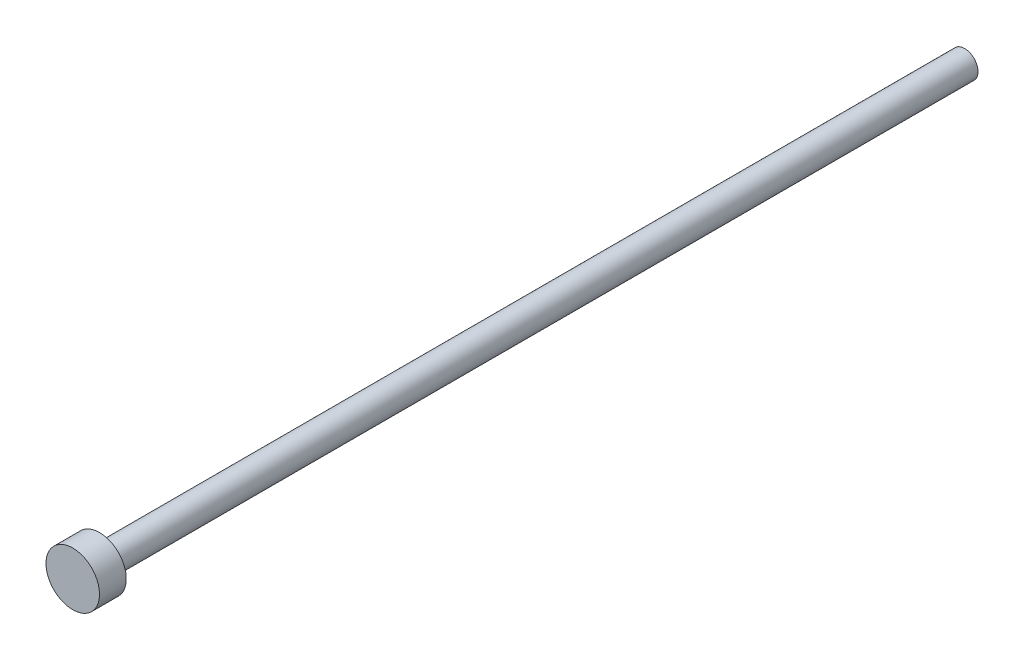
from build123d import *


with BuildPart() as part:
    # Sketch1 → Revolve1 (revolve)
    with BuildSketch(Plane(origin=(0, -18, -1.35), x_dir=(0, 0, -1), z_dir=(1, 0, 0)), mode=Mode.PRIVATE) as revolve1_sk:
        with BuildLine():
            Line((-1.35, 18), (-1.35, 21))
            Line((-1.35, 21), (1.65, 21))
            Line((1.65, 21), (1.65, 19.8))
            ThreePointArc((1.65, 19.8), (1.737867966, 19.587867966), (1.95, 19.5))
            Line((1.95, 19.5), (98.65, 19.5))
            Line((98.65, 19.5), (98.65, 18))
            Line((98.65, 18), (-1.35, 18))
        make_face()
    revolve(revolve1_sk.sketch.rotate(Axis((0, 0, 0), (0, 0, 1)), 90), axis=Axis((0, 0, 0), (0, 0, 1)))


solid = part.part
